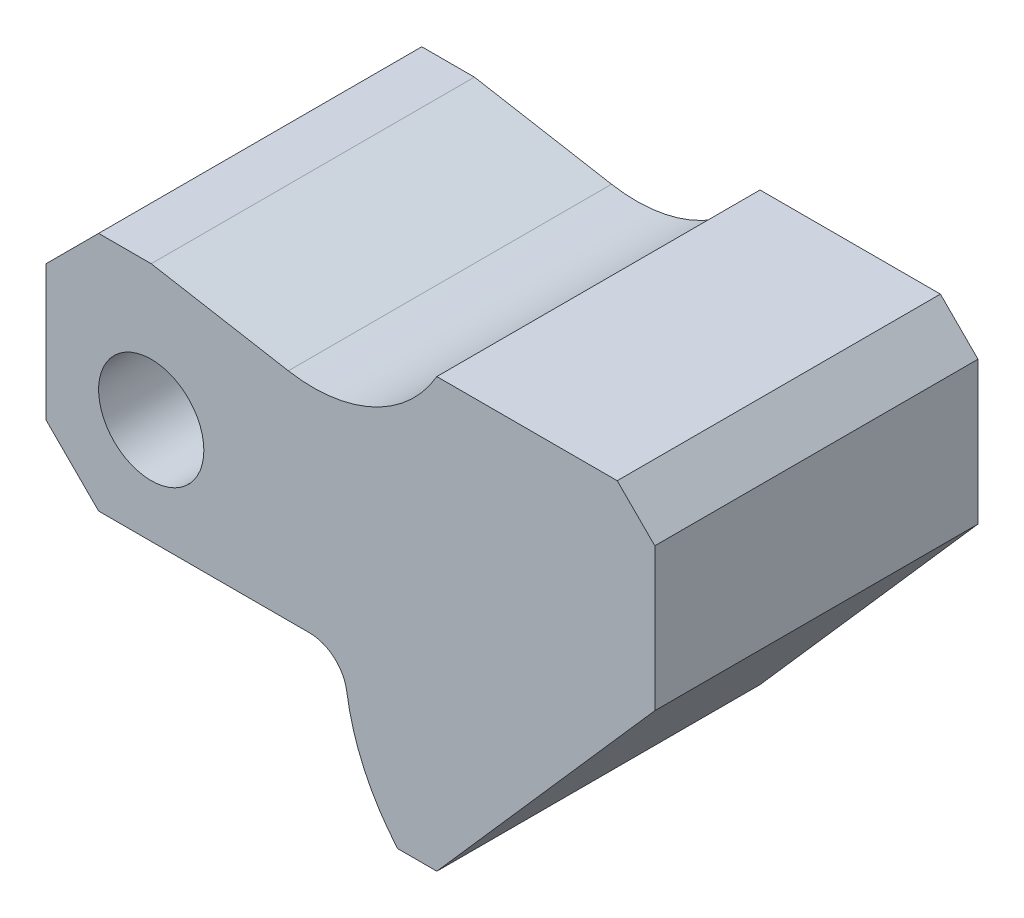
from build123d import *

# Parameters (mm, degrees)
BOSS_EXTRUDE1_DEPTH = 21.5
CHAMFER1_SIZE       = 7
CHAMFER2_SIZE       = 5
SKETCH2_R           = 7
CUT_EXTRUDE1_DEPTH  = 100.26731587


with BuildPart() as part:
    # Sketch1 → Boss-Extrude1 (new, symmetric)
    with BuildSketch(Plane.XY):
        with BuildLine():
            Line((0, 0), (0, 32))
            Line((0, 32), (14, 32))
            Line((14, 32), (32.243084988, 28.783251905))
            ThreePointArc((32.243084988, 28.783251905), (43.574972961, 30.276069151), (52, 38))
            Line((52, 38), (81, 38))
            Line((81, 38), (81, 14))
            Line((81, 14), (52, -19))
            Line((52, -19), (46.788067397, -19))
            ThreePointArc((46.788067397, -19), (42.3490952, -12.115672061), (40.012264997, -4.264705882))
            ThreePointArc((40.012264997, -4.264705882), (38.331862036, -1.213413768), (35.066626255, 0))
            Line((35.066626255, 0), (0, 0))
        make_face()
    extrude(amount=BOSS_EXTRUDE1_DEPTH, both=True)

    # Chamfer1
    chamfer1_edges = [part.edges().sort_by_distance(p)[0] for p in [
        (0, 0, 0),
        (0, 32, 0),
    ]]
    chamfer(chamfer1_edges, length=CHAMFER1_SIZE)

    # Chamfer2
    chamfer2_edges = [part.edges().sort_by_distance(p)[0] for p in [
        (81, 38, 0),
    ]]
    chamfer(chamfer2_edges, length=CHAMFER2_SIZE)

    # Sketch2 → Cut-Extrude1 (cut, through all)
    with BuildSketch(Plane.XY.offset(21.5)):
        with Locations((14, 14)):
            Circle(SKETCH2_R)
    extrude(amount=-CUT_EXTRUDE1_DEPTH, mode=Mode.SUBTRACT)


solid = part.part
